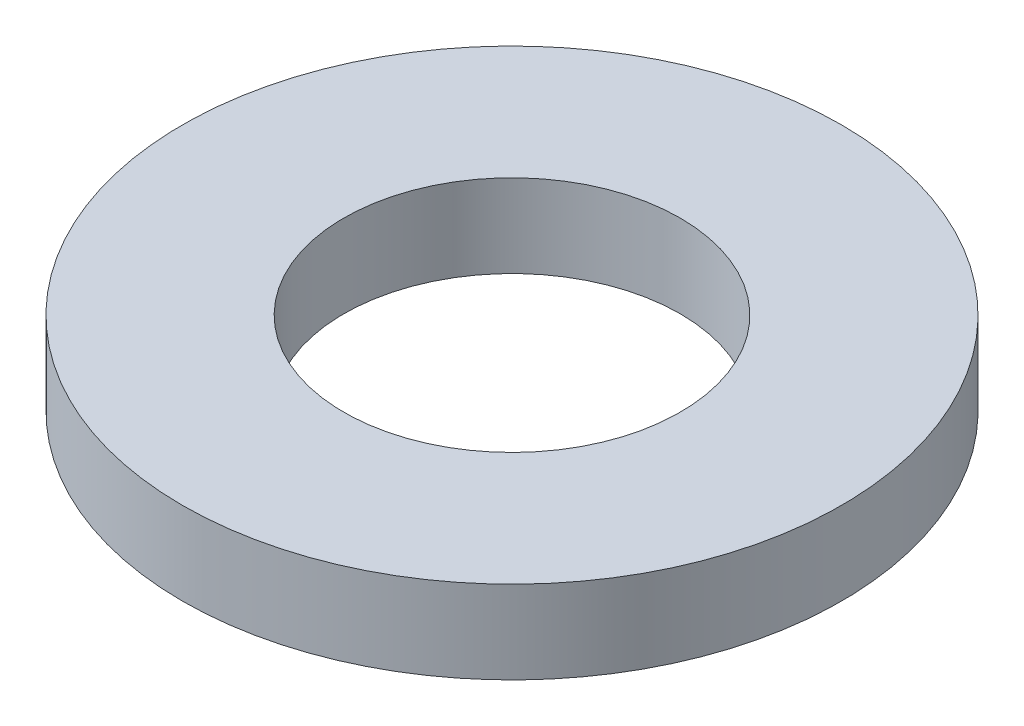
from build123d import *

# Parameters (mm, degrees)
SKETCH1_R           = 19.05
SKETCH1_R_2         = 9.7234375
BOSS_EXTRUDE1_DEPTH = 4.79425


with BuildPart() as part:
    # Sketch1 → Boss-Extrude1 (new body)
    with BuildSketch(Plane(origin=(0, 0, 0), x_dir=(1, 0, 0), z_dir=(0, 1, 0))):
        with Locations(Location((0, 0, 0), (0, 0, 90))):
            Circle(SKETCH1_R)
        with Locations(Location((0, 0, 0), (0, 0, 90))):
            Circle(SKETCH1_R_2, mode=Mode.SUBTRACT)
    extrude(amount=BOSS_EXTRUDE1_DEPTH)


solid = part.part
